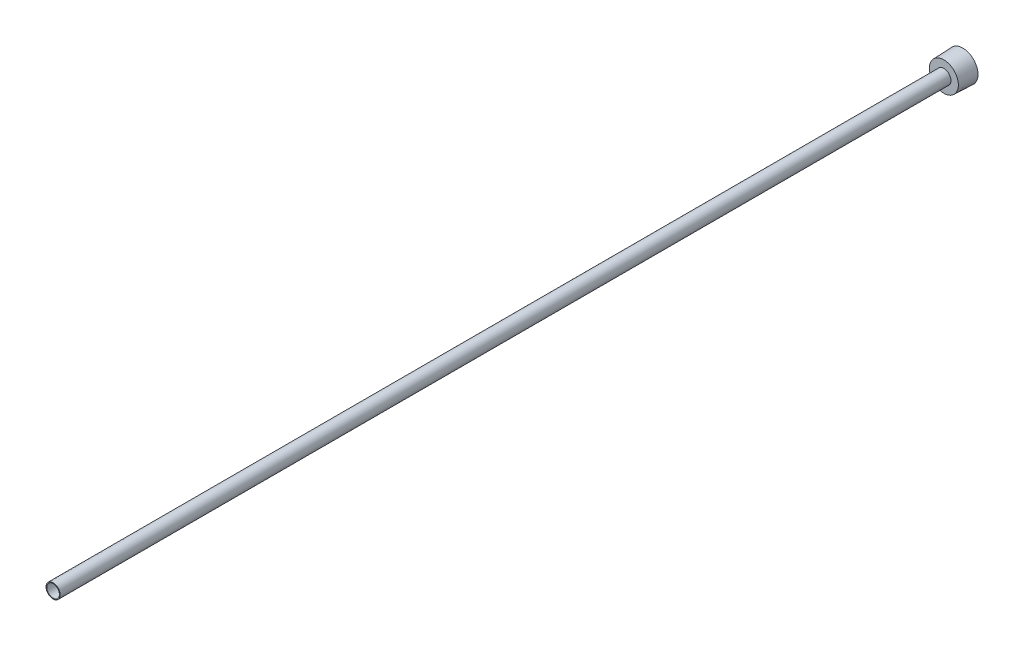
from build123d import *

# Parameters (mm, degrees)
SKETCH2_R          = 2.1209
CUT_EXTRUDE1_DEPTH = 305.885078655
CUT_EXTRUDE2_DEPTH = 4.7625


with BuildPart() as part:
    # Sketch1 → Revolve1 (revolve)
    with BuildSketch(Plane(origin=(0, 0, 0), x_dir=(0, 0, -1), z_dir=(1, 0, 0)), mode=Mode.PRIVATE) as revolve1_sk:
        Polygon((0, 0), (0, 5.0927), (-6.35, 4.861076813), (-6.35, 2.3749), (-304.8, 2.3749), (-304.8, 0), align=None)
    revolve(revolve1_sk.sketch.rotate(Axis((0, 0, 0), (0, 0, -1)), 180), axis=Axis((0, 0, 0), (0, 0, -1)))

    # Sketch2 → Cut-Extrude1 (cut, through all)
    with BuildSketch(Plane.XY.offset(304.8)):
        Circle(SKETCH2_R)
    extrude(amount=-CUT_EXTRUDE1_DEPTH, mode=Mode.SUBTRACT)

    # Sketch3 → Cut-Extrude2 (cut)
    with BuildSketch(Plane(origin=(0, 0, 0), x_dir=(-1, 0, 0), z_dir=(0, 0, -1))):
        Polygon((0, -3.666174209), (3.175, -1.833087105), (3.175, 1.833087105), (0, 3.666174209), (-3.175, 1.833087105), (-3.175, -1.833087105), align=None)
    extrude(amount=-CUT_EXTRUDE2_DEPTH, mode=Mode.SUBTRACT)


solid = part.part
